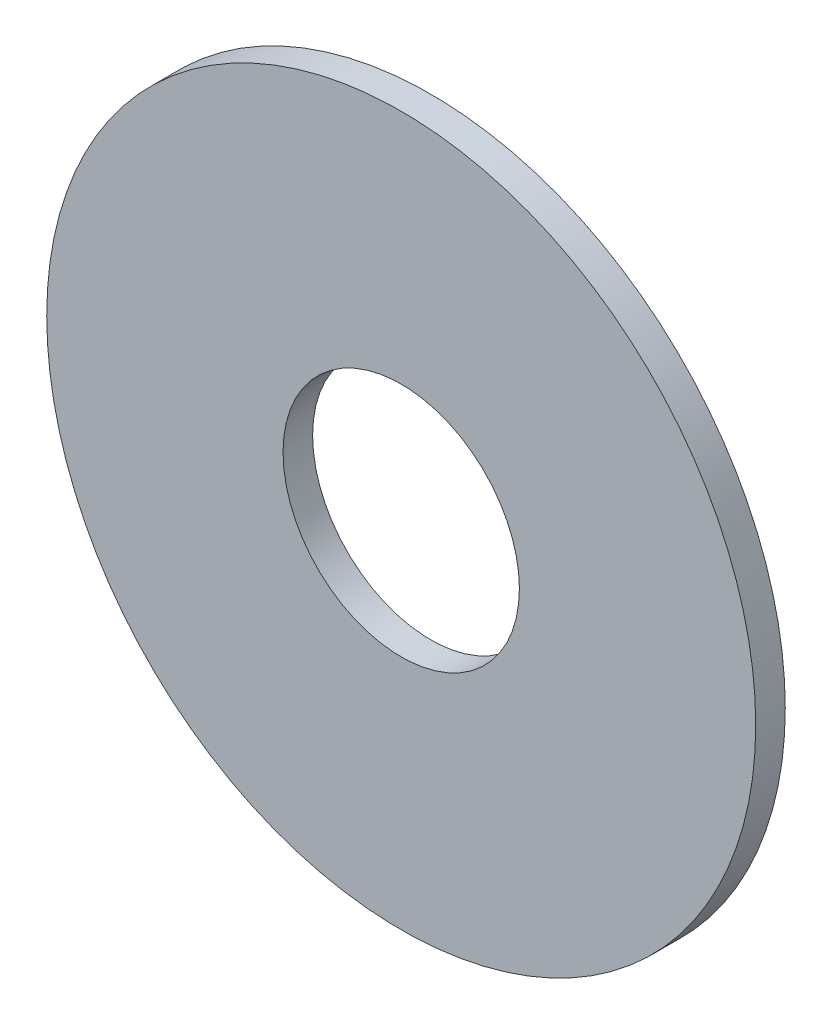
ISO-10303-21;
HEADER;
FILE_DESCRIPTION(('STEP AP214'),'2;1');
FILE_NAME('part.step','',(''),(''),'','','');
FILE_SCHEMA(('AUTOMOTIVE_DESIGN { 1 0 10303 214 1 1 1 1 }'));
ENDSEC;
DATA;
#1=APPLICATION_CONTEXT('core data for automotive mechanical design processes');
#2=APPLICATION_PROTOCOL_DEFINITION('international standard','automotive_design',2000,#1);
#3=PRODUCT_CONTEXT('',#1,'mechanical');
#4=PRODUCT('Part','Part','',(#3));
#5=PRODUCT_RELATED_PRODUCT_CATEGORY('part','',(#4));
#6=PRODUCT_DEFINITION_FORMATION('','',#4);
#7=PRODUCT_DEFINITION_CONTEXT('part definition',#1,'design');
#8=PRODUCT_DEFINITION('design','',#6,#7);
#9=PRODUCT_DEFINITION_SHAPE('','',#8);
#10=(LENGTH_UNIT() NAMED_UNIT(*) SI_UNIT(.MILLI.,.METRE.));
#11=(NAMED_UNIT(*) PLANE_ANGLE_UNIT() SI_UNIT($,.RADIAN.));
#12=(NAMED_UNIT(*) SI_UNIT($,.STERADIAN.) SOLID_ANGLE_UNIT());
#13=UNCERTAINTY_MEASURE_WITH_UNIT(LENGTH_MEASURE(1.E-05),#10,'distance_accuracy_value','');
#14=(GEOMETRIC_REPRESENTATION_CONTEXT(3) GLOBAL_UNCERTAINTY_ASSIGNED_CONTEXT((#13)) GLOBAL_UNIT_ASSIGNED_CONTEXT((#10,
#11,#12)) REPRESENTATION_CONTEXT('',''));
#15=CARTESIAN_POINT('',(0.,0.,0.));
#16=DIRECTION('',(0.,0.,1.));
#17=DIRECTION('',(1.,0.,0.));
#18=AXIS2_PLACEMENT_3D('',#15,#16,#17);
#19=CARTESIAN_POINT('',(-9.99999999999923,-20.,1.00000000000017));
#20=DIRECTION('',(0.,0.,1.));
#21=DIRECTION('',(1.,0.,0.));
#22=AXIS2_PLACEMENT_3D('',#19,#20,#21);
#23=PLANE('',#22);
#24=CARTESIAN_POINT('',(-9.99999999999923,-20.,1.00000000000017));
#25=DIRECTION('',(0.,0.,1.));
#26=DIRECTION('',(1.,0.,0.));
#27=AXIS2_PLACEMENT_3D('',#24,#25,#26);
#28=CIRCLE('',#27,12.);
#29=CARTESIAN_POINT('',(2.00000000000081,-20.0000000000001,1.00000000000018));
#30=VERTEX_POINT('',#29);
#31=EDGE_CURVE('E10',#30,#30,#28,.T.);
#32=ORIENTED_EDGE('',*,*,#31,.T.);
#33=EDGE_LOOP('',(#32));
#34=FACE_BOUND('',#33,.T.);
#35=CARTESIAN_POINT('',(-9.99999999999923,-20.,1.00000000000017));
#36=DIRECTION('',(0.,0.,1.));
#37=DIRECTION('',(1.,0.,0.));
#38=AXIS2_PLACEMENT_3D('',#35,#36,#37);
#39=CIRCLE('',#38,4.);
#40=CARTESIAN_POINT('',(-5.99999999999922,-20.,1.00000000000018));
#41=VERTEX_POINT('',#40);
#42=EDGE_CURVE('E48',#41,#41,#39,.T.);
#43=ORIENTED_EDGE('',*,*,#42,.F.);
#44=EDGE_LOOP('',(#43));
#45=FACE_BOUND('',#44,.T.);
#46=ADVANCED_FACE('F34',(#34,#45),#23,.T.);
#47=CARTESIAN_POINT('',(-9.9999999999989,-20.0000000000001,1.2490009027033E-13));
#48=DIRECTION('',(0.,0.,1.));
#49=DIRECTION('',(1.,0.,0.));
#50=AXIS2_PLACEMENT_3D('',#47,#48,#49);
#51=PLANE('',#50);
#52=CARTESIAN_POINT('',(-9.9999999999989,-20.0000000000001,1.2490009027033E-13));
#53=DIRECTION('',(0.,0.,1.));
#54=DIRECTION('',(1.,0.,0.));
#55=AXIS2_PLACEMENT_3D('',#52,#53,#54);
#56=CIRCLE('',#55,12.);
#57=CARTESIAN_POINT('',(2.00000000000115,-20.0000000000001,1.28896893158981E-13));
#58=VERTEX_POINT('',#57);
#59=EDGE_CURVE('E38',#58,#58,#56,.T.);
#60=ORIENTED_EDGE('',*,*,#59,.F.);
#61=EDGE_LOOP('',(#60));
#62=FACE_BOUND('',#61,.T.);
#63=CARTESIAN_POINT('',(-9.9999999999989,-20.0000000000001,1.2490009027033E-13));
#64=DIRECTION('',(0.,0.,1.));
#65=DIRECTION('',(1.,0.,0.));
#66=AXIS2_PLACEMENT_3D('',#63,#64,#65);
#67=CIRCLE('',#66,4.);
#68=CARTESIAN_POINT('',(-5.99999999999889,-20.0000000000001,1.2623235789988E-13));
#69=VERTEX_POINT('',#68);
#70=EDGE_CURVE('E50',#69,#69,#67,.T.);
#71=ORIENTED_EDGE('',*,*,#70,.T.);
#72=EDGE_LOOP('',(#71));
#73=FACE_BOUND('',#72,.T.);
#74=ADVANCED_FACE('F63',(#62,#73),#51,.F.);
#75=CARTESIAN_POINT('',(-9.99999999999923,-20.,1.00000000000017));
#76=DIRECTION('',(0.,0.,-1.));
#77=DIRECTION('',(-1.,0.,0.));
#78=AXIS2_PLACEMENT_3D('',#75,#76,#77);
#79=CYLINDRICAL_SURFACE('',#78,12.);
#80=ORIENTED_EDGE('',*,*,#31,.F.);
#81=EDGE_LOOP('',(#80));
#82=FACE_BOUND('',#81,.T.);
#83=ORIENTED_EDGE('',*,*,#59,.T.);
#84=EDGE_LOOP('',(#83));
#85=FACE_BOUND('',#84,.T.);
#86=ADVANCED_FACE('F36',(#82,#85),#79,.T.);
#87=CARTESIAN_POINT('',(-9.99999999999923,-20.,1.00000000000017));
#88=DIRECTION('',(0.,0.,-1.));
#89=DIRECTION('',(-1.,0.,0.));
#90=AXIS2_PLACEMENT_3D('',#87,#88,#89);
#91=CYLINDRICAL_SURFACE('',#90,4.);
#92=ORIENTED_EDGE('',*,*,#42,.T.);
#93=EDGE_LOOP('',(#92));
#94=FACE_BOUND('',#93,.T.);
#95=ORIENTED_EDGE('',*,*,#70,.F.);
#96=EDGE_LOOP('',(#95));
#97=FACE_BOUND('',#96,.T.);
#98=ADVANCED_FACE('F59',(#94,#97),#91,.F.);
#99=CLOSED_SHELL('',(#46,#74,#86,#98));
#100=MANIFOLD_SOLID_BREP('B2',#99);
#101=ADVANCED_BREP_SHAPE_REPRESENTATION('',(#18,#100),#14);
#102=SHAPE_DEFINITION_REPRESENTATION(#9,#101);
ENDSEC;
END-ISO-10303-21;
